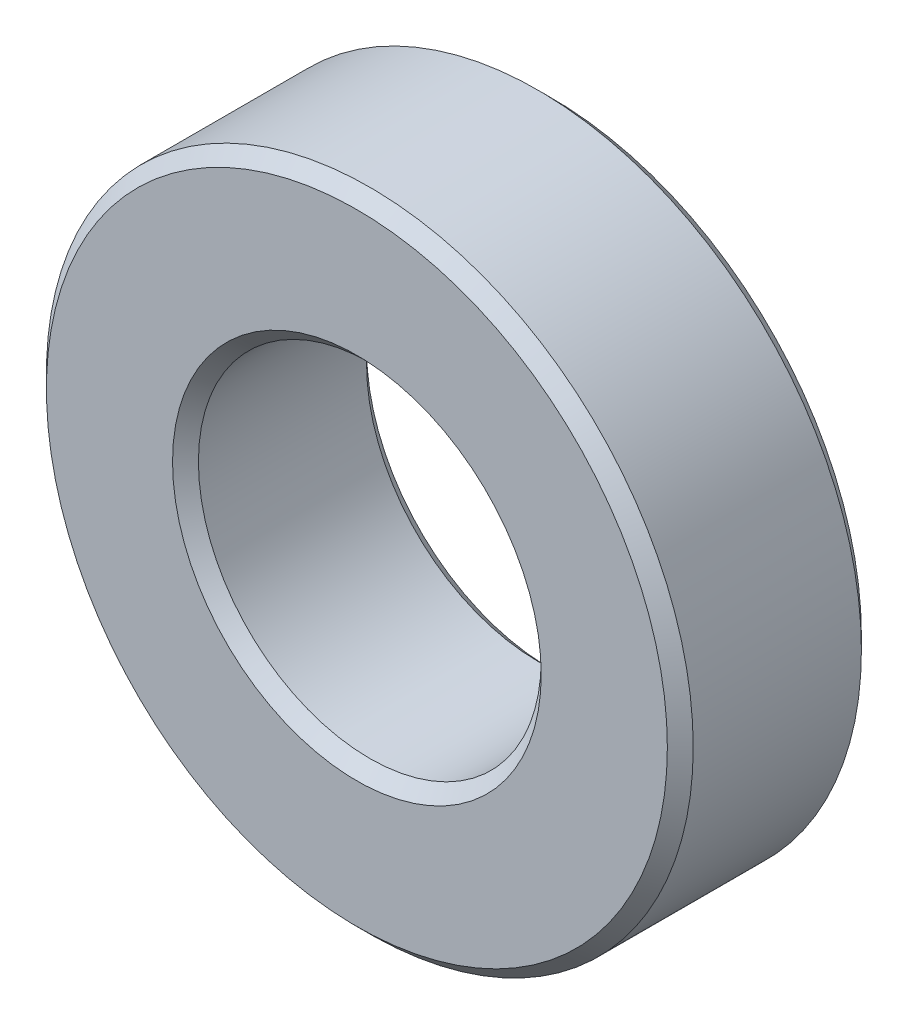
ISO-10303-21;
HEADER;
FILE_DESCRIPTION(('STEP AP214'),'2;1');
FILE_NAME('part.step','',(''),(''),'','','');
FILE_SCHEMA(('AUTOMOTIVE_DESIGN { 1 0 10303 214 1 1 1 1 }'));
ENDSEC;
DATA;
#1=APPLICATION_CONTEXT('core data for automotive mechanical design processes');
#2=APPLICATION_PROTOCOL_DEFINITION('international standard','automotive_design',2000,#1);
#3=PRODUCT_CONTEXT('',#1,'mechanical');
#4=PRODUCT('Part','Part','',(#3));
#5=PRODUCT_RELATED_PRODUCT_CATEGORY('part','',(#4));
#6=PRODUCT_DEFINITION_FORMATION('','',#4);
#7=PRODUCT_DEFINITION_CONTEXT('part definition',#1,'design');
#8=PRODUCT_DEFINITION('design','',#6,#7);
#9=PRODUCT_DEFINITION_SHAPE('','',#8);
#10=(LENGTH_UNIT() NAMED_UNIT(*) SI_UNIT(.MILLI.,.METRE.));
#11=(NAMED_UNIT(*) PLANE_ANGLE_UNIT() SI_UNIT($,.RADIAN.));
#12=(NAMED_UNIT(*) SI_UNIT($,.STERADIAN.) SOLID_ANGLE_UNIT());
#13=UNCERTAINTY_MEASURE_WITH_UNIT(LENGTH_MEASURE(1.E-05),#10,'distance_accuracy_value','');
#14=(GEOMETRIC_REPRESENTATION_CONTEXT(3) GLOBAL_UNCERTAINTY_ASSIGNED_CONTEXT((#13)) GLOBAL_UNIT_ASSIGNED_CONTEXT((#10,
#11,#12)) REPRESENTATION_CONTEXT('',''));
#15=CARTESIAN_POINT('',(0.,0.,0.));
#16=DIRECTION('',(0.,0.,1.));
#17=DIRECTION('',(1.,0.,0.));
#18=AXIS2_PLACEMENT_3D('',#15,#16,#17);
#19=CARTESIAN_POINT('',(0.,0.,1.5));
#20=DIRECTION('',(0.,0.,1.));
#21=DIRECTION('',(1.,0.,0.));
#22=AXIS2_PLACEMENT_3D('',#19,#20,#21);
#23=PLANE('',#22);
#24=CARTESIAN_POINT('',(0.,0.,1.5));
#25=DIRECTION('',(0.,0.,1.));
#26=DIRECTION('',(1.,0.,0.));
#27=AXIS2_PLACEMENT_3D('',#24,#25,#26);
#28=CIRCLE('',#27,2.85);
#29=CARTESIAN_POINT('',(2.85,0.,1.5));
#30=VERTEX_POINT('',#29);
#31=EDGE_CURVE('E10',#30,#30,#28,.F.);
#32=ORIENTED_EDGE('',*,*,#31,.T.);
#33=EDGE_LOOP('',(#32));
#34=FACE_BOUND('',#33,.T.);
#35=CARTESIAN_POINT('',(0.,0.,1.5));
#36=DIRECTION('',(0.,0.,1.));
#37=DIRECTION('',(1.,0.,0.));
#38=AXIS2_PLACEMENT_3D('',#35,#36,#37);
#39=CIRCLE('',#38,4.8);
#40=CARTESIAN_POINT('',(4.8,0.,1.5));
#41=VERTEX_POINT('',#40);
#42=EDGE_CURVE('E45',#41,#41,#39,.T.);
#43=ORIENTED_EDGE('',*,*,#42,.T.);
#44=EDGE_LOOP('',(#43));
#45=FACE_BOUND('',#44,.T.);
#46=ADVANCED_FACE('F37',(#34,#45),#23,.T.);
#47=CARTESIAN_POINT('',(0.,0.,-1.5));
#48=DIRECTION('',(0.,0.,1.));
#49=DIRECTION('',(1.,0.,0.));
#50=AXIS2_PLACEMENT_3D('',#47,#48,#49);
#51=PLANE('',#50);
#52=CARTESIAN_POINT('',(0.,0.,-1.5));
#53=DIRECTION('',(0.,0.,1.));
#54=DIRECTION('',(1.,0.,0.));
#55=AXIS2_PLACEMENT_3D('',#52,#53,#54);
#56=CIRCLE('',#55,4.8);
#57=CARTESIAN_POINT('',(4.8,0.,-1.5));
#58=VERTEX_POINT('',#57);
#59=EDGE_CURVE('E63',#58,#58,#56,.F.);
#60=ORIENTED_EDGE('',*,*,#59,.T.);
#61=EDGE_LOOP('',(#60));
#62=FACE_BOUND('',#61,.T.);
#63=CARTESIAN_POINT('',(0.,0.,-1.5));
#64=DIRECTION('',(0.,0.,1.));
#65=DIRECTION('',(1.,0.,0.));
#66=AXIS2_PLACEMENT_3D('',#63,#64,#65);
#67=CIRCLE('',#66,2.85);
#68=CARTESIAN_POINT('',(2.85,0.,-1.5));
#69=VERTEX_POINT('',#68);
#70=EDGE_CURVE('E67',#69,#69,#67,.T.);
#71=ORIENTED_EDGE('',*,*,#70,.T.);
#72=EDGE_LOOP('',(#71));
#73=FACE_BOUND('',#72,.T.);
#74=ADVANCED_FACE('F89',(#62,#73),#51,.F.);
#75=CARTESIAN_POINT('',(0.,0.,1.5));
#76=DIRECTION('',(0.,0.,-1.));
#77=DIRECTION('',(-1.,0.,0.));
#78=AXIS2_PLACEMENT_3D('',#75,#76,#77);
#79=CYLINDRICAL_SURFACE('',#78,5.);
#80=CARTESIAN_POINT('',(0.,0.,-1.3));
#81=DIRECTION('',(0.,0.,1.));
#82=DIRECTION('',(1.,0.,0.));
#83=AXIS2_PLACEMENT_3D('',#80,#81,#82);
#84=CIRCLE('',#83,5.);
#85=CARTESIAN_POINT('',(5.,0.,-1.3));
#86=VERTEX_POINT('',#85);
#87=EDGE_CURVE('E70',#86,#86,#84,.T.);
#88=ORIENTED_EDGE('',*,*,#87,.T.);
#89=EDGE_LOOP('',(#88));
#90=FACE_BOUND('',#89,.T.);
#91=CARTESIAN_POINT('',(0.,0.,1.3));
#92=DIRECTION('',(0.,0.,1.));
#93=DIRECTION('',(1.,0.,0.));
#94=AXIS2_PLACEMENT_3D('',#91,#92,#93);
#95=CIRCLE('',#94,5.);
#96=CARTESIAN_POINT('',(5.,0.,1.3));
#97=VERTEX_POINT('',#96);
#98=EDGE_CURVE('E74',#97,#97,#95,.F.);
#99=ORIENTED_EDGE('',*,*,#98,.T.);
#100=EDGE_LOOP('',(#99));
#101=FACE_BOUND('',#100,.T.);
#102=ADVANCED_FACE('F78',(#90,#101),#79,.T.);
#103=CARTESIAN_POINT('',(0.,0.,1.5));
#104=DIRECTION('',(0.,0.,-1.));
#105=DIRECTION('',(-1.,0.,0.));
#106=AXIS2_PLACEMENT_3D('',#103,#104,#105);
#107=CYLINDRICAL_SURFACE('',#106,2.65);
#108=CARTESIAN_POINT('',(0.,0.,-1.3));
#109=DIRECTION('',(0.,0.,1.));
#110=DIRECTION('',(1.,0.,0.));
#111=AXIS2_PLACEMENT_3D('',#108,#109,#110);
#112=CIRCLE('',#111,2.65);
#113=CARTESIAN_POINT('',(2.65,0.,-1.3));
#114=VERTEX_POINT('',#113);
#115=EDGE_CURVE('E51',#114,#114,#112,.F.);
#116=ORIENTED_EDGE('',*,*,#115,.T.);
#117=EDGE_LOOP('',(#116));
#118=FACE_BOUND('',#117,.T.);
#119=CARTESIAN_POINT('',(0.,0.,1.3));
#120=DIRECTION('',(0.,0.,1.));
#121=DIRECTION('',(1.,0.,0.));
#122=AXIS2_PLACEMENT_3D('',#119,#120,#121);
#123=CIRCLE('',#122,2.65);
#124=CARTESIAN_POINT('',(2.65,0.,1.3));
#125=VERTEX_POINT('',#124);
#126=EDGE_CURVE('E58',#125,#125,#123,.T.);
#127=ORIENTED_EDGE('',*,*,#126,.T.);
#128=EDGE_LOOP('',(#127));
#129=FACE_BOUND('',#128,.T.);
#130=ADVANCED_FACE('F97',(#118,#129),#107,.F.);
#131=CARTESIAN_POINT('',(0.,0.,-1.3));
#132=DIRECTION('',(0.,0.,1.));
#133=DIRECTION('',(1.,0.,0.));
#134=AXIS2_PLACEMENT_3D('',#131,#132,#133);
#135=CONICAL_SURFACE('',#134,5.,0.785398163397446);
#136=ORIENTED_EDGE('',*,*,#59,.F.);
#137=EDGE_LOOP('',(#136));
#138=FACE_BOUND('',#137,.T.);
#139=ORIENTED_EDGE('',*,*,#87,.F.);
#140=EDGE_LOOP('',(#139));
#141=FACE_BOUND('',#140,.T.);
#142=ADVANCED_FACE('F102',(#138,#141),#135,.T.);
#143=CARTESIAN_POINT('',(0.,0.,-1.5));
#144=DIRECTION('',(0.,0.,-1.));
#145=DIRECTION('',(-1.,0.,0.));
#146=AXIS2_PLACEMENT_3D('',#143,#144,#145);
#147=CONICAL_SURFACE('',#146,2.85,0.785398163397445);
#148=ORIENTED_EDGE('',*,*,#115,.F.);
#149=EDGE_LOOP('',(#148));
#150=FACE_BOUND('',#149,.T.);
#151=ORIENTED_EDGE('',*,*,#70,.F.);
#152=EDGE_LOOP('',(#151));
#153=FACE_BOUND('',#152,.T.);
#154=ADVANCED_FACE('F86',(#150,#153),#147,.F.);
#155=CARTESIAN_POINT('',(0.,0.,1.3));
#156=DIRECTION('',(0.,0.,1.));
#157=DIRECTION('',(1.,0.,0.));
#158=AXIS2_PLACEMENT_3D('',#155,#156,#157);
#159=CONICAL_SURFACE('',#158,2.65,0.785398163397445);
#160=ORIENTED_EDGE('',*,*,#31,.F.);
#161=EDGE_LOOP('',(#160));
#162=FACE_BOUND('',#161,.T.);
#163=ORIENTED_EDGE('',*,*,#126,.F.);
#164=EDGE_LOOP('',(#163));
#165=FACE_BOUND('',#164,.T.);
#166=ADVANCED_FACE('F82',(#162,#165),#159,.F.);
#167=CARTESIAN_POINT('',(0.,0.,1.5));
#168=DIRECTION('',(0.,0.,-1.));
#169=DIRECTION('',(-1.,0.,0.));
#170=AXIS2_PLACEMENT_3D('',#167,#168,#169);
#171=CONICAL_SURFACE('',#170,4.8,0.785398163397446);
#172=ORIENTED_EDGE('',*,*,#98,.F.);
#173=EDGE_LOOP('',(#172));
#174=FACE_BOUND('',#173,.T.);
#175=ORIENTED_EDGE('',*,*,#42,.F.);
#176=EDGE_LOOP('',(#175));
#177=FACE_BOUND('',#176,.T.);
#178=ADVANCED_FACE('F39',(#174,#177),#171,.T.);
#179=CLOSED_SHELL('',(#46,#74,#102,#130,#142,#154,#166,#178));
#180=MANIFOLD_SOLID_BREP('B2',#179);
#181=ADVANCED_BREP_SHAPE_REPRESENTATION('',(#18,#180),#14);
#182=SHAPE_DEFINITION_REPRESENTATION(#9,#181);
ENDSEC;
END-ISO-10303-21;
